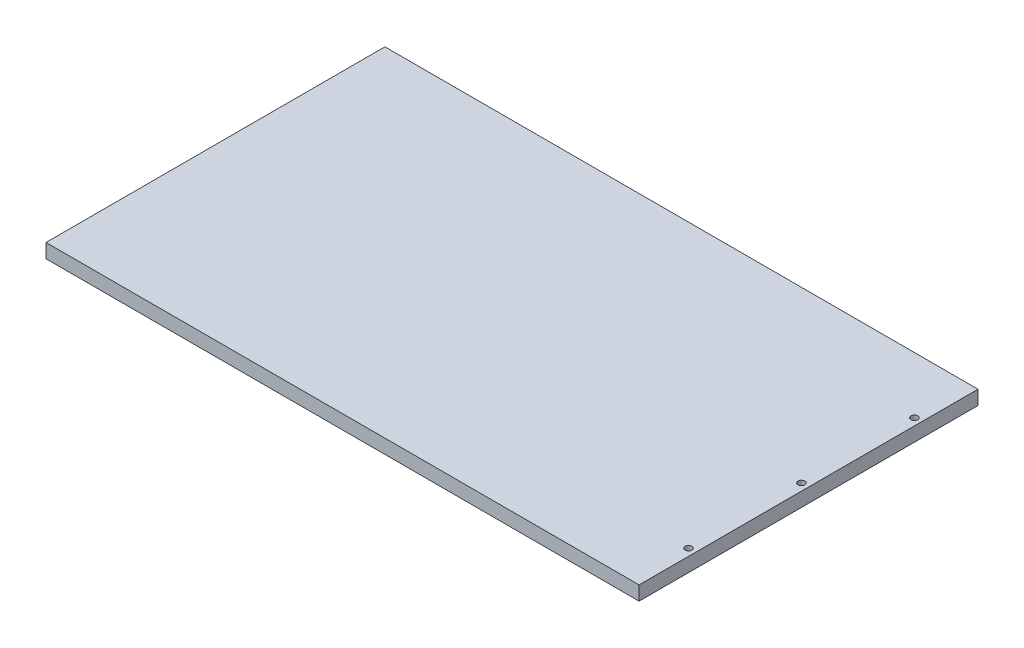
from build123d import *

# Parameters (mm, degrees)
SKETCH1_W                  = 266.7
SKETCH1_H                  = 152.4
BOSS_EXTRUDE1_DEPTH        = 6.35
F_4_40_TAPPED_HOLE1_D      = 2.2606
F_4_40_TAPPED_HOLE1_DEPTH  = 7.62
F_4_40_TAPPED_HOLE1_TIP    = 0.679152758
F_31_0_12_DIAMETER_HOLE1_D = 3.048


with BuildPart() as part:
    # Sketch1 → Boss-Extrude1 (new body)
    with BuildSketch(Plane(origin=(0, 0, 0), x_dir=(1, 0, 0), z_dir=(0, 1, 0))):
        Rectangle(SKETCH1_W, SKETCH1_H)
    extrude(amount=BOSS_EXTRUDE1_DEPTH)

    # 4-40 Tapped Hole1
    with Locations(Plane.ZY.offset(133.35)):
        with Locations((0, 3.175), (-50.8, 3.175), (50.8, 3.175)):
            Hole(F_4_40_TAPPED_HOLE1_D / 2, depth=F_4_40_TAPPED_HOLE1_DEPTH)
            with Locations((0, 0, -(F_4_40_TAPPED_HOLE1_DEPTH + F_4_40_TAPPED_HOLE1_TIP / 2))):  # 118° drill point
                Cone(0, F_4_40_TAPPED_HOLE1_D / 2, F_4_40_TAPPED_HOLE1_TIP, mode=Mode.SUBTRACT)

    # 31 _0.12_ Diameter Hole1 (through all)
    with Locations(Plane(origin=(0, 6.35, 0), x_dir=(1, 0, 0), z_dir=(0, 1, 0))):
        with Locations((130.175, 0), (130.175, 50.8), (130.175, -50.8)):
            Hole(F_31_0_12_DIAMETER_HOLE1_D / 2)


solid = part.part
